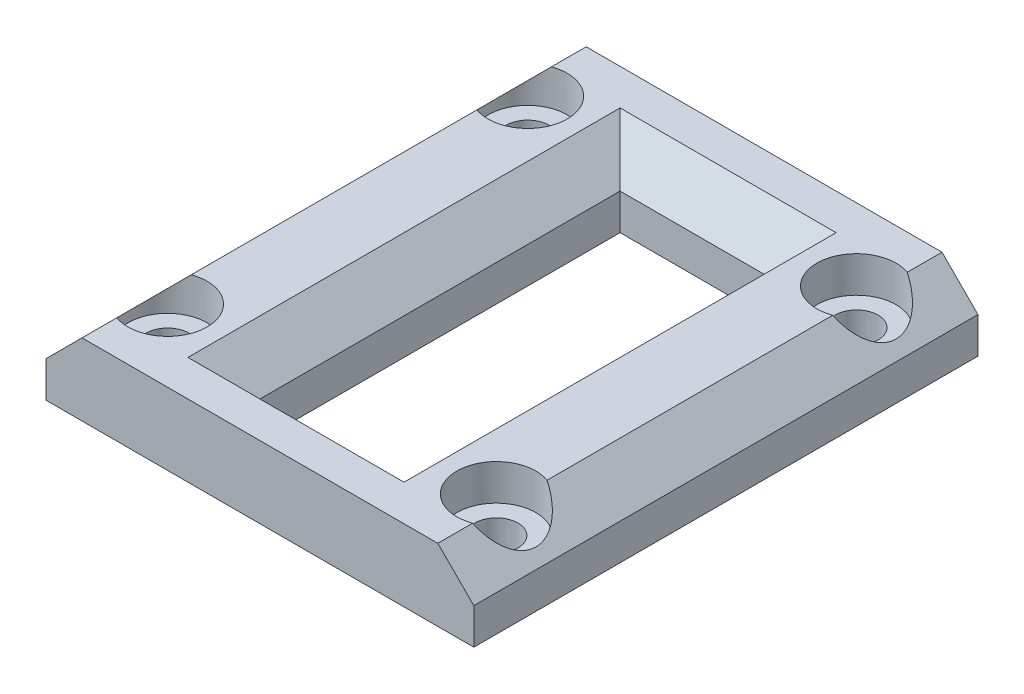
ISO-10303-21;
HEADER;
FILE_DESCRIPTION(('STEP AP214'),'2;1');
FILE_NAME('part.step','',(''),(''),'','','');
FILE_SCHEMA(('AUTOMOTIVE_DESIGN { 1 0 10303 214 1 1 1 1 }'));
ENDSEC;
DATA;
#1=APPLICATION_CONTEXT('core data for automotive mechanical design processes');
#2=APPLICATION_PROTOCOL_DEFINITION('international standard','automotive_design',2000,#1);
#3=PRODUCT_CONTEXT('',#1,'mechanical');
#4=PRODUCT('Part','Part','',(#3));
#5=PRODUCT_RELATED_PRODUCT_CATEGORY('part','',(#4));
#6=PRODUCT_DEFINITION_FORMATION('','',#4);
#7=PRODUCT_DEFINITION_CONTEXT('part definition',#1,'design');
#8=PRODUCT_DEFINITION('design','',#6,#7);
#9=PRODUCT_DEFINITION_SHAPE('','',#8);
#10=(LENGTH_UNIT() NAMED_UNIT(*) SI_UNIT(.MILLI.,.METRE.));
#11=(NAMED_UNIT(*) PLANE_ANGLE_UNIT() SI_UNIT($,.RADIAN.));
#12=(NAMED_UNIT(*) SI_UNIT($,.STERADIAN.) SOLID_ANGLE_UNIT());
#13=UNCERTAINTY_MEASURE_WITH_UNIT(LENGTH_MEASURE(1.E-05),#10,'distance_accuracy_value','');
#14=(GEOMETRIC_REPRESENTATION_CONTEXT(3) GLOBAL_UNCERTAINTY_ASSIGNED_CONTEXT((#13)) GLOBAL_UNIT_ASSIGNED_CONTEXT((#10,
#11,#12)) REPRESENTATION_CONTEXT('',''));
#15=CARTESIAN_POINT('',(0.,0.,0.));
#16=DIRECTION('',(0.,0.,1.));
#17=DIRECTION('',(1.,0.,0.));
#18=AXIS2_PLACEMENT_3D('',#15,#16,#17);
#19=CARTESIAN_POINT('',(0.,4.,0.));
#20=DIRECTION('',(1.,0.,0.));
#21=DIRECTION('',(0.,0.,-1.));
#22=AXIS2_PLACEMENT_3D('',#19,#20,#21);
#23=PLANE('',#22);
#24=DIRECTION('',(0.,-1.,0.));
#25=VECTOR('',#24,1.);
#26=CARTESIAN_POINT('',(0.,4.,28.));
#27=LINE('',#26,#25);
#28=CARTESIAN_POINT('',(0.,1.99999999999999,28.));
#29=VERTEX_POINT('',#28);
#30=CARTESIAN_POINT('',(0.,0.,28.));
#31=VERTEX_POINT('',#30);
#32=EDGE_CURVE('E257',#29,#31,#27,.T.);
#33=ORIENTED_EDGE('',*,*,#32,.F.);
#34=DIRECTION('',(0.,0.,-1.));
#35=VECTOR('',#34,1.);
#36=CARTESIAN_POINT('',(0.,1.99999999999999,0.));
#37=LINE('',#36,#35);
#38=CARTESIAN_POINT('',(0.,1.99999999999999,0.));
#39=VERTEX_POINT('',#38);
#40=EDGE_CURVE('E56',#29,#39,#37,.T.);
#41=ORIENTED_EDGE('',*,*,#40,.T.);
#42=DIRECTION('',(0.,-1.,0.));
#43=VECTOR('',#42,1.);
#44=CARTESIAN_POINT('',(0.,4.,0.));
#45=LINE('',#44,#43);
#46=CARTESIAN_POINT('',(0.,0.,0.));
#47=VERTEX_POINT('',#46);
#48=EDGE_CURVE('E241',#39,#47,#45,.T.);
#49=ORIENTED_EDGE('',*,*,#48,.T.);
#50=DIRECTION('',(0.,0.,1.));
#51=VECTOR('',#50,1.);
#52=CARTESIAN_POINT('',(0.,0.,0.));
#53=LINE('',#52,#51);
#54=EDGE_CURVE('E233',#47,#31,#53,.T.);
#55=ORIENTED_EDGE('',*,*,#54,.T.);
#56=EDGE_LOOP('',(#33,#41,#49,#55));
#57=FACE_BOUND('',#56,.T.);
#58=ADVANCED_FACE('F33',(#57),#23,.F.);
#59=CARTESIAN_POINT('',(0.,4.,28.));
#60=DIRECTION('',(0.,0.,-1.));
#61=DIRECTION('',(-1.,0.,0.));
#62=AXIS2_PLACEMENT_3D('',#59,#60,#61);
#63=PLANE('',#62);
#64=DIRECTION('',(1.,0.,0.));
#65=VECTOR('',#64,1.);
#66=CARTESIAN_POINT('',(0.,4.,28.));
#67=LINE('',#66,#65);
#68=CARTESIAN_POINT('',(2.,4.,28.));
#69=VERTEX_POINT('',#68);
#70=CARTESIAN_POINT('',(21.76,4.,28.));
#71=VERTEX_POINT('',#70);
#72=EDGE_CURVE('E234',#69,#71,#67,.T.);
#73=ORIENTED_EDGE('',*,*,#72,.F.);
#74=DIRECTION('',(-0.707106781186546,-0.707106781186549,0.));
#75=VECTOR('',#74,1.);
#76=CARTESIAN_POINT('',(2.,4.,28.));
#77=LINE('',#76,#75);
#78=EDGE_CURVE('E308',#69,#29,#77,.T.);
#79=ORIENTED_EDGE('',*,*,#78,.T.);
#80=ORIENTED_EDGE('',*,*,#32,.T.);
#81=DIRECTION('',(1.,0.,0.));
#82=VECTOR('',#81,1.);
#83=CARTESIAN_POINT('',(0.,0.,28.));
#84=LINE('',#83,#82);
#85=CARTESIAN_POINT('',(23.76,0.,28.));
#86=VERTEX_POINT('',#85);
#87=EDGE_CURVE('E244',#31,#86,#84,.T.);
#88=ORIENTED_EDGE('',*,*,#87,.T.);
#89=DIRECTION('',(0.,-1.,0.));
#90=VECTOR('',#89,1.);
#91=CARTESIAN_POINT('',(23.76,4.,28.));
#92=LINE('',#91,#90);
#93=CARTESIAN_POINT('',(23.76,1.99999999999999,28.));
#94=VERTEX_POINT('',#93);
#95=EDGE_CURVE('E255',#94,#86,#92,.T.);
#96=ORIENTED_EDGE('',*,*,#95,.F.);
#97=DIRECTION('',(-0.707106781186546,0.707106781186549,0.));
#98=VECTOR('',#97,1.);
#99=CARTESIAN_POINT('',(21.76,4.,28.));
#100=LINE('',#99,#98);
#101=EDGE_CURVE('E306',#94,#71,#100,.T.);
#102=ORIENTED_EDGE('',*,*,#101,.T.);
#103=EDGE_LOOP('',(#73,#79,#80,#88,#96,#102));
#104=FACE_BOUND('',#103,.T.);
#105=ADVANCED_FACE('F333',(#104),#63,.F.);
#106=CARTESIAN_POINT('',(23.76,4.,0.));
#107=DIRECTION('',(-1.,0.,0.));
#108=DIRECTION('',(0.,0.,1.));
#109=AXIS2_PLACEMENT_3D('',#106,#107,#108);
#110=PLANE('',#109);
#111=DIRECTION('',(0.,-1.,0.));
#112=VECTOR('',#111,1.);
#113=CARTESIAN_POINT('',(23.76,4.,0.));
#114=LINE('',#113,#112);
#115=CARTESIAN_POINT('',(23.76,1.99999999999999,0.));
#116=VERTEX_POINT('',#115);
#117=CARTESIAN_POINT('',(23.76,0.,0.));
#118=VERTEX_POINT('',#117);
#119=EDGE_CURVE('E253',#116,#118,#114,.T.);
#120=ORIENTED_EDGE('',*,*,#119,.F.);
#121=DIRECTION('',(0.,0.,1.));
#122=VECTOR('',#121,1.);
#123=CARTESIAN_POINT('',(23.76,1.99999999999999,28.));
#124=LINE('',#123,#122);
#125=EDGE_CURVE('E11',#116,#94,#124,.T.);
#126=ORIENTED_EDGE('',*,*,#125,.T.);
#127=ORIENTED_EDGE('',*,*,#95,.T.);
#128=DIRECTION('',(0.,0.,-1.));
#129=VECTOR('',#128,1.);
#130=CARTESIAN_POINT('',(23.76,0.,0.));
#131=LINE('',#130,#129);
#132=EDGE_CURVE('E247',#86,#118,#131,.T.);
#133=ORIENTED_EDGE('',*,*,#132,.T.);
#134=EDGE_LOOP('',(#120,#126,#127,#133));
#135=FACE_BOUND('',#134,.T.);
#136=ADVANCED_FACE('F330',(#135),#110,.F.);
#137=CARTESIAN_POINT('',(0.,4.,0.));
#138=DIRECTION('',(0.,0.,1.));
#139=DIRECTION('',(1.,0.,0.));
#140=AXIS2_PLACEMENT_3D('',#137,#138,#139);
#141=PLANE('',#140);
#142=ORIENTED_EDGE('',*,*,#48,.F.);
#143=DIRECTION('',(0.707106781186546,0.707106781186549,0.));
#144=VECTOR('',#143,1.);
#145=CARTESIAN_POINT('',(2.,4.,0.));
#146=LINE('',#145,#144);
#147=CARTESIAN_POINT('',(2.,4.,0.));
#148=VERTEX_POINT('',#147);
#149=EDGE_CURVE('E312',#39,#148,#146,.T.);
#150=ORIENTED_EDGE('',*,*,#149,.T.);
#151=DIRECTION('',(-1.,0.,0.));
#152=VECTOR('',#151,1.);
#153=CARTESIAN_POINT('',(0.,4.,0.));
#154=LINE('',#153,#152);
#155=CARTESIAN_POINT('',(21.76,4.,0.));
#156=VERTEX_POINT('',#155);
#157=EDGE_CURVE('E237',#156,#148,#154,.T.);
#158=ORIENTED_EDGE('',*,*,#157,.F.);
#159=DIRECTION('',(0.707106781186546,-0.707106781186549,0.));
#160=VECTOR('',#159,1.);
#161=CARTESIAN_POINT('',(21.76,4.,0.));
#162=LINE('',#161,#160);
#163=EDGE_CURVE('E48',#156,#116,#162,.T.);
#164=ORIENTED_EDGE('',*,*,#163,.T.);
#165=ORIENTED_EDGE('',*,*,#119,.T.);
#166=DIRECTION('',(-1.,0.,0.));
#167=VECTOR('',#166,1.);
#168=CARTESIAN_POINT('',(0.,0.,0.));
#169=LINE('',#168,#167);
#170=EDGE_CURVE('E238',#118,#47,#169,.T.);
#171=ORIENTED_EDGE('',*,*,#170,.T.);
#172=EDGE_LOOP('',(#142,#150,#158,#164,#165,#171));
#173=FACE_BOUND('',#172,.T.);
#174=ADVANCED_FACE('F339',(#173),#141,.F.);
#175=CARTESIAN_POINT('',(0.,4.,0.));
#176=DIRECTION('',(0.,1.,0.));
#177=DIRECTION('',(0.,0.,1.));
#178=AXIS2_PLACEMENT_3D('',#175,#176,#177);
#179=PLANE('',#178);
#180=DIRECTION('',(1.,0.,0.));
#181=VECTOR('',#180,1.);
#182=CARTESIAN_POINT('',(15.882828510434,4.,1.99999999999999));
#183=LINE('',#182,#181);
#184=CARTESIAN_POINT('',(5.88282851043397,4.,1.99999999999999));
#185=VERTEX_POINT('',#184);
#186=CARTESIAN_POINT('',(17.882828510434,4.,1.99999999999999));
#187=VERTEX_POINT('',#186);
#188=EDGE_CURVE('E261',#185,#187,#183,.T.);
#189=ORIENTED_EDGE('',*,*,#188,.T.);
#190=DIRECTION('',(0.,0.,1.));
#191=VECTOR('',#190,1.);
#192=CARTESIAN_POINT('',(17.882828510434,4.,26.));
#193=LINE('',#192,#191);
#194=CARTESIAN_POINT('',(17.882828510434,4.,26.));
#195=VERTEX_POINT('',#194);
#196=EDGE_CURVE('E274',#187,#195,#193,.T.);
#197=ORIENTED_EDGE('',*,*,#196,.T.);
#198=DIRECTION('',(-1.,0.,0.));
#199=VECTOR('',#198,1.);
#200=CARTESIAN_POINT('',(7.88282851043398,4.,26.));
#201=LINE('',#200,#199);
#202=CARTESIAN_POINT('',(5.88282851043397,4.,26.));
#203=VERTEX_POINT('',#202);
#204=EDGE_CURVE('E263',#195,#203,#201,.T.);
#205=ORIENTED_EDGE('',*,*,#204,.T.);
#206=DIRECTION('',(0.,0.,-1.));
#207=VECTOR('',#206,1.);
#208=CARTESIAN_POINT('',(5.88282851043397,4.,1.99999999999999));
#209=LINE('',#208,#207);
#210=EDGE_CURVE('E271',#203,#185,#209,.T.);
#211=ORIENTED_EDGE('',*,*,#210,.T.);
#212=EDGE_LOOP('',(#189,#197,#205,#211));
#213=FACE_BOUND('',#212,.T.);
#214=ORIENTED_EDGE('',*,*,#157,.T.);
#215=DIRECTION('',(0.,0.,1.));
#216=VECTOR('',#215,1.);
#217=CARTESIAN_POINT('',(2.,4.,28.));
#218=LINE('',#217,#216);
#219=CARTESIAN_POINT('',(2.,4.,1.93178821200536));
#220=VERTEX_POINT('',#219);
#221=EDGE_CURVE('E299',#148,#220,#218,.T.);
#222=ORIENTED_EDGE('',*,*,#221,.T.);
#223=CARTESIAN_POINT('',(2.75,4.,4.));
#224=DIRECTION('',(0.,1.,0.));
#225=DIRECTION('',(0.,0.,1.));
#226=AXIS2_PLACEMENT_3D('',#223,#224,#225);
#227=CIRCLE('',#226,2.19999999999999);
#228=CARTESIAN_POINT('',(2.,4.,6.06821178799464));
#229=VERTEX_POINT('',#228);
#230=EDGE_CURVE('E181',#229,#220,#227,.T.);
#231=ORIENTED_EDGE('',*,*,#230,.F.);
#232=DIRECTION('',(0.,0.,1.));
#233=VECTOR('',#232,1.);
#234=CARTESIAN_POINT('',(2.,4.,28.));
#235=LINE('',#234,#233);
#236=CARTESIAN_POINT('',(2.,4.,21.9317882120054));
#237=VERTEX_POINT('',#236);
#238=EDGE_CURVE('E297',#229,#237,#235,.T.);
#239=ORIENTED_EDGE('',*,*,#238,.T.);
#240=CARTESIAN_POINT('',(2.75,4.,24.));
#241=DIRECTION('',(0.,1.,0.));
#242=DIRECTION('',(0.,0.,1.));
#243=AXIS2_PLACEMENT_3D('',#240,#241,#242);
#244=CIRCLE('',#243,2.19999999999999);
#245=CARTESIAN_POINT('',(2.,4.,26.0682117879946));
#246=VERTEX_POINT('',#245);
#247=EDGE_CURVE('E197',#246,#237,#244,.T.);
#248=ORIENTED_EDGE('',*,*,#247,.F.);
#249=DIRECTION('',(0.,0.,1.));
#250=VECTOR('',#249,1.);
#251=CARTESIAN_POINT('',(2.,4.,28.));
#252=LINE('',#251,#250);
#253=EDGE_CURVE('E295',#246,#69,#252,.T.);
#254=ORIENTED_EDGE('',*,*,#253,.T.);
#255=ORIENTED_EDGE('',*,*,#72,.T.);
#256=DIRECTION('',(0.,0.,-1.));
#257=VECTOR('',#256,1.);
#258=CARTESIAN_POINT('',(21.76,4.,0.));
#259=LINE('',#258,#257);
#260=CARTESIAN_POINT('',(21.76,4.,26.0682117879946));
#261=VERTEX_POINT('',#260);
#262=EDGE_CURVE('E292',#71,#261,#259,.T.);
#263=ORIENTED_EDGE('',*,*,#262,.T.);
#264=CARTESIAN_POINT('',(21.01,4.,24.));
#265=DIRECTION('',(0.,1.,0.));
#266=DIRECTION('',(0.,0.,1.));
#267=AXIS2_PLACEMENT_3D('',#264,#265,#266);
#268=CIRCLE('',#267,2.19999999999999);
#269=CARTESIAN_POINT('',(21.76,4.,21.9317882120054));
#270=VERTEX_POINT('',#269);
#271=EDGE_CURVE('E209',#270,#261,#268,.T.);
#272=ORIENTED_EDGE('',*,*,#271,.F.);
#273=DIRECTION('',(0.,0.,-1.));
#274=VECTOR('',#273,1.);
#275=CARTESIAN_POINT('',(21.76,4.,0.));
#276=LINE('',#275,#274);
#277=CARTESIAN_POINT('',(21.76,4.,6.06821178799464));
#278=VERTEX_POINT('',#277);
#279=EDGE_CURVE('E290',#270,#278,#276,.T.);
#280=ORIENTED_EDGE('',*,*,#279,.T.);
#281=CARTESIAN_POINT('',(21.01,4.,4.));
#282=DIRECTION('',(0.,1.,0.));
#283=DIRECTION('',(0.,0.,1.));
#284=AXIS2_PLACEMENT_3D('',#281,#282,#283);
#285=CIRCLE('',#284,2.19999999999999);
#286=CARTESIAN_POINT('',(21.76,4.,1.93178821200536));
#287=VERTEX_POINT('',#286);
#288=EDGE_CURVE('E221',#287,#278,#285,.T.);
#289=ORIENTED_EDGE('',*,*,#288,.F.);
#290=DIRECTION('',(0.,0.,-1.));
#291=VECTOR('',#290,1.);
#292=CARTESIAN_POINT('',(21.76,4.,0.));
#293=LINE('',#292,#291);
#294=EDGE_CURVE('E288',#287,#156,#293,.T.);
#295=ORIENTED_EDGE('',*,*,#294,.T.);
#296=EDGE_LOOP('',(#214,#222,#231,#239,#248,#254,#255,#263,#272,#280,#289,#295));
#297=FACE_BOUND('',#296,.T.);
#298=ADVANCED_FACE('F323',(#213,#297),#179,.T.);
#299=CARTESIAN_POINT('',(0.,0.,0.));
#300=DIRECTION('',(0.,1.,0.));
#301=DIRECTION('',(0.,0.,1.));
#302=AXIS2_PLACEMENT_3D('',#299,#300,#301);
#303=PLANE('',#302);
#304=DIRECTION('',(-1.,0.,0.));
#305=VECTOR('',#304,1.);
#306=CARTESIAN_POINT('',(7.88282851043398,0.,4.));
#307=LINE('',#306,#305);
#308=CARTESIAN_POINT('',(15.882828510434,0.,4.));
#309=VERTEX_POINT('',#308);
#310=CARTESIAN_POINT('',(7.88282851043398,0.,4.));
#311=VERTEX_POINT('',#310);
#312=EDGE_CURVE('E161',#309,#311,#307,.T.);
#313=ORIENTED_EDGE('',*,*,#312,.T.);
#314=DIRECTION('',(0.,0.,1.));
#315=VECTOR('',#314,1.);
#316=CARTESIAN_POINT('',(7.88282851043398,0.,4.));
#317=LINE('',#316,#315);
#318=CARTESIAN_POINT('',(7.88282851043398,0.,24.));
#319=VERTEX_POINT('',#318);
#320=EDGE_CURVE('E153',#311,#319,#317,.T.);
#321=ORIENTED_EDGE('',*,*,#320,.T.);
#322=DIRECTION('',(1.,0.,0.));
#323=VECTOR('',#322,1.);
#324=CARTESIAN_POINT('',(7.88282851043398,0.,24.));
#325=LINE('',#324,#323);
#326=CARTESIAN_POINT('',(15.882828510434,0.,24.));
#327=VERTEX_POINT('',#326);
#328=EDGE_CURVE('E165',#319,#327,#325,.T.);
#329=ORIENTED_EDGE('',*,*,#328,.T.);
#330=DIRECTION('',(0.,0.,-1.));
#331=VECTOR('',#330,1.);
#332=CARTESIAN_POINT('',(15.882828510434,0.,4.));
#333=LINE('',#332,#331);
#334=EDGE_CURVE('E170',#327,#309,#333,.T.);
#335=ORIENTED_EDGE('',*,*,#334,.T.);
#336=EDGE_LOOP('',(#313,#321,#329,#335));
#337=FACE_BOUND('',#336,.T.);
#338=CARTESIAN_POINT('',(2.75,0.,4.));
#339=DIRECTION('',(0.,1.,0.));
#340=DIRECTION('',(0.,0.,1.));
#341=AXIS2_PLACEMENT_3D('',#338,#339,#340);
#342=CIRCLE('',#341,1.2);
#343=CARTESIAN_POINT('',(2.75,0.,5.2));
#344=VERTEX_POINT('',#343);
#345=EDGE_CURVE('E194',#344,#344,#342,.T.);
#346=ORIENTED_EDGE('',*,*,#345,.T.);
#347=EDGE_LOOP('',(#346));
#348=FACE_BOUND('',#347,.T.);
#349=CARTESIAN_POINT('',(2.75,0.,24.));
#350=DIRECTION('',(0.,1.,0.));
#351=DIRECTION('',(0.,0.,1.));
#352=AXIS2_PLACEMENT_3D('',#349,#350,#351);
#353=CIRCLE('',#352,1.2);
#354=CARTESIAN_POINT('',(2.75,0.,25.2));
#355=VERTEX_POINT('',#354);
#356=EDGE_CURVE('E206',#355,#355,#353,.T.);
#357=ORIENTED_EDGE('',*,*,#356,.T.);
#358=EDGE_LOOP('',(#357));
#359=FACE_BOUND('',#358,.T.);
#360=CARTESIAN_POINT('',(21.01,0.,24.));
#361=DIRECTION('',(0.,1.,0.));
#362=DIRECTION('',(0.,0.,1.));
#363=AXIS2_PLACEMENT_3D('',#360,#361,#362);
#364=CIRCLE('',#363,1.2);
#365=CARTESIAN_POINT('',(21.01,0.,25.2));
#366=VERTEX_POINT('',#365);
#367=EDGE_CURVE('E218',#366,#366,#364,.T.);
#368=ORIENTED_EDGE('',*,*,#367,.T.);
#369=EDGE_LOOP('',(#368));
#370=FACE_BOUND('',#369,.T.);
#371=CARTESIAN_POINT('',(21.01,0.,4.));
#372=DIRECTION('',(0.,1.,0.));
#373=DIRECTION('',(0.,0.,1.));
#374=AXIS2_PLACEMENT_3D('',#371,#372,#373);
#375=CIRCLE('',#374,1.2);
#376=CARTESIAN_POINT('',(21.01,0.,5.2));
#377=VERTEX_POINT('',#376);
#378=EDGE_CURVE('E230',#377,#377,#375,.T.);
#379=ORIENTED_EDGE('',*,*,#378,.T.);
#380=EDGE_LOOP('',(#379));
#381=FACE_BOUND('',#380,.T.);
#382=ORIENTED_EDGE('',*,*,#54,.F.);
#383=ORIENTED_EDGE('',*,*,#170,.F.);
#384=ORIENTED_EDGE('',*,*,#132,.F.);
#385=ORIENTED_EDGE('',*,*,#87,.F.);
#386=EDGE_LOOP('',(#382,#383,#384,#385));
#387=FACE_BOUND('',#386,.T.);
#388=ADVANCED_FACE('F172',(#337,#348,#359,#370,#381,#387),#303,.F.);
#389=CARTESIAN_POINT('',(21.01,4.,4.));
#390=DIRECTION('',(0.,1.,0.));
#391=DIRECTION('',(0.,0.,1.));
#392=AXIS2_PLACEMENT_3D('',#389,#390,#391);
#393=CYLINDRICAL_SURFACE('',#392,1.2);
#394=ORIENTED_EDGE('',*,*,#378,.F.);
#395=EDGE_LOOP('',(#394));
#396=FACE_BOUND('',#395,.T.);
#397=CARTESIAN_POINT('',(21.01,2.,4.));
#398=DIRECTION('',(0.,1.,0.));
#399=DIRECTION('',(0.,0.,1.));
#400=AXIS2_PLACEMENT_3D('',#397,#398,#399);
#401=CIRCLE('',#400,1.20000000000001);
#402=CARTESIAN_POINT('',(21.01,2.,5.20000000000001));
#403=VERTEX_POINT('',#402);
#404=EDGE_CURVE('E227',#403,#403,#401,.T.);
#405=ORIENTED_EDGE('',*,*,#404,.T.);
#406=EDGE_LOOP('',(#405));
#407=FACE_BOUND('',#406,.T.);
#408=ADVANCED_FACE('F547',(#396,#407),#393,.F.);
#409=CARTESIAN_POINT('',(22.21,2.,4.));
#410=DIRECTION('',(0.,-1.,0.));
#411=DIRECTION('',(0.,0.,-1.));
#412=AXIS2_PLACEMENT_3D('',#409,#410,#411);
#413=PLANE('',#412);
#414=ORIENTED_EDGE('',*,*,#404,.F.);
#415=EDGE_LOOP('',(#414));
#416=FACE_BOUND('',#415,.T.);
#417=CARTESIAN_POINT('',(21.01,2.,4.));
#418=DIRECTION('',(0.,1.,0.));
#419=DIRECTION('',(0.,0.,1.));
#420=AXIS2_PLACEMENT_3D('',#417,#418,#419);
#421=CIRCLE('',#420,2.19999999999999);
#422=CARTESIAN_POINT('',(21.01,2.,6.19999999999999));
#423=VERTEX_POINT('',#422);
#424=EDGE_CURVE('E224',#423,#423,#421,.T.);
#425=ORIENTED_EDGE('',*,*,#424,.T.);
#426=EDGE_LOOP('',(#425));
#427=FACE_BOUND('',#426,.T.);
#428=ADVANCED_FACE('F444',(#416,#427),#413,.F.);
#429=CARTESIAN_POINT('',(21.01,4.,4.));
#430=DIRECTION('',(0.,1.,0.));
#431=DIRECTION('',(0.,0.,1.));
#432=AXIS2_PLACEMENT_3D('',#429,#430,#431);
#433=CYLINDRICAL_SURFACE('',#432,2.19999999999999);
#434=ORIENTED_EDGE('',*,*,#424,.F.);
#435=EDGE_LOOP('',(#434));
#436=FACE_BOUND('',#435,.T.);
#437=ORIENTED_EDGE('',*,*,#288,.T.);
#438=CARTESIAN_POINT('',(21.01,4.75,4.));
#439=DIRECTION('',(0.707106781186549,0.707106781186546,0.));
#440=DIRECTION('',(-0.707106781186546,0.707106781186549,0.));
#441=AXIS2_PLACEMENT_3D('',#438,#439,#440);
#442=ELLIPSE('',#441,3.11126983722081,2.19999999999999);
#443=EDGE_CURVE('E41',#278,#287,#442,.T.);
#444=ORIENTED_EDGE('',*,*,#443,.T.);
#445=EDGE_LOOP('',(#437,#444));
#446=FACE_BOUND('',#445,.T.);
#447=ADVANCED_FACE('F318',(#436,#446),#433,.F.);
#448=CARTESIAN_POINT('',(21.01,4.,24.));
#449=DIRECTION('',(0.,1.,0.));
#450=DIRECTION('',(0.,0.,1.));
#451=AXIS2_PLACEMENT_3D('',#448,#449,#450);
#452=CYLINDRICAL_SURFACE('',#451,1.2);
#453=ORIENTED_EDGE('',*,*,#367,.F.);
#454=EDGE_LOOP('',(#453));
#455=FACE_BOUND('',#454,.T.);
#456=CARTESIAN_POINT('',(21.01,2.,24.));
#457=DIRECTION('',(0.,1.,0.));
#458=DIRECTION('',(0.,0.,1.));
#459=AXIS2_PLACEMENT_3D('',#456,#457,#458);
#460=CIRCLE('',#459,1.20000000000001);
#461=CARTESIAN_POINT('',(21.01,2.,25.2));
#462=VERTEX_POINT('',#461);
#463=EDGE_CURVE('E215',#462,#462,#460,.T.);
#464=ORIENTED_EDGE('',*,*,#463,.T.);
#465=EDGE_LOOP('',(#464));
#466=FACE_BOUND('',#465,.T.);
#467=ADVANCED_FACE('F443',(#455,#466),#452,.F.);
#468=CARTESIAN_POINT('',(22.21,2.,24.));
#469=DIRECTION('',(0.,-1.,0.));
#470=DIRECTION('',(0.,0.,-1.));
#471=AXIS2_PLACEMENT_3D('',#468,#469,#470);
#472=PLANE('',#471);
#473=ORIENTED_EDGE('',*,*,#463,.F.);
#474=EDGE_LOOP('',(#473));
#475=FACE_BOUND('',#474,.T.);
#476=CARTESIAN_POINT('',(21.01,2.,24.));
#477=DIRECTION('',(0.,1.,0.));
#478=DIRECTION('',(0.,0.,1.));
#479=AXIS2_PLACEMENT_3D('',#476,#477,#478);
#480=CIRCLE('',#479,2.19999999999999);
#481=CARTESIAN_POINT('',(21.01,2.,26.2));
#482=VERTEX_POINT('',#481);
#483=EDGE_CURVE('E212',#482,#482,#480,.T.);
#484=ORIENTED_EDGE('',*,*,#483,.T.);
#485=EDGE_LOOP('',(#484));
#486=FACE_BOUND('',#485,.T.);
#487=ADVANCED_FACE('F429',(#475,#486),#472,.F.);
#488=CARTESIAN_POINT('',(21.01,4.,24.));
#489=DIRECTION('',(0.,1.,0.));
#490=DIRECTION('',(0.,0.,1.));
#491=AXIS2_PLACEMENT_3D('',#488,#489,#490);
#492=CYLINDRICAL_SURFACE('',#491,2.19999999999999);
#493=ORIENTED_EDGE('',*,*,#483,.F.);
#494=EDGE_LOOP('',(#493));
#495=FACE_BOUND('',#494,.T.);
#496=ORIENTED_EDGE('',*,*,#271,.T.);
#497=CARTESIAN_POINT('',(21.01,4.75,24.));
#498=DIRECTION('',(0.707106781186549,0.707106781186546,0.));
#499=DIRECTION('',(-0.707106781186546,0.707106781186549,0.));
#500=AXIS2_PLACEMENT_3D('',#497,#498,#499);
#501=ELLIPSE('',#500,3.11126983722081,2.19999999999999);
#502=EDGE_CURVE('E314',#261,#270,#501,.T.);
#503=ORIENTED_EDGE('',*,*,#502,.T.);
#504=EDGE_LOOP('',(#496,#503));
#505=FACE_BOUND('',#504,.T.);
#506=ADVANCED_FACE('F423',(#495,#505),#492,.F.);
#507=CARTESIAN_POINT('',(2.75,4.,24.));
#508=DIRECTION('',(0.,1.,0.));
#509=DIRECTION('',(0.,0.,1.));
#510=AXIS2_PLACEMENT_3D('',#507,#508,#509);
#511=CYLINDRICAL_SURFACE('',#510,1.20000000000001);
#512=ORIENTED_EDGE('',*,*,#356,.F.);
#513=EDGE_LOOP('',(#512));
#514=FACE_BOUND('',#513,.T.);
#515=CARTESIAN_POINT('',(2.75,2.,24.));
#516=DIRECTION('',(0.,1.,0.));
#517=DIRECTION('',(0.,0.,1.));
#518=AXIS2_PLACEMENT_3D('',#515,#516,#517);
#519=CIRCLE('',#518,1.20000000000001);
#520=CARTESIAN_POINT('',(2.75,2.,25.2));
#521=VERTEX_POINT('',#520);
#522=EDGE_CURVE('E203',#521,#521,#519,.T.);
#523=ORIENTED_EDGE('',*,*,#522,.T.);
#524=EDGE_LOOP('',(#523));
#525=FACE_BOUND('',#524,.T.);
#526=ADVANCED_FACE('F428',(#514,#525),#511,.F.);
#527=CARTESIAN_POINT('',(3.95000000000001,2.,24.));
#528=DIRECTION('',(0.,-1.,0.));
#529=DIRECTION('',(0.,0.,-1.));
#530=AXIS2_PLACEMENT_3D('',#527,#528,#529);
#531=PLANE('',#530);
#532=ORIENTED_EDGE('',*,*,#522,.F.);
#533=EDGE_LOOP('',(#532));
#534=FACE_BOUND('',#533,.T.);
#535=CARTESIAN_POINT('',(2.75,2.,24.));
#536=DIRECTION('',(0.,1.,0.));
#537=DIRECTION('',(0.,0.,1.));
#538=AXIS2_PLACEMENT_3D('',#535,#536,#537);
#539=CIRCLE('',#538,2.19999999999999);
#540=CARTESIAN_POINT('',(2.75,2.,26.2));
#541=VERTEX_POINT('',#540);
#542=EDGE_CURVE('E200',#541,#541,#539,.T.);
#543=ORIENTED_EDGE('',*,*,#542,.T.);
#544=EDGE_LOOP('',(#543));
#545=FACE_BOUND('',#544,.T.);
#546=ADVANCED_FACE('F413',(#534,#545),#531,.F.);
#547=CARTESIAN_POINT('',(2.75,4.,24.));
#548=DIRECTION('',(0.,1.,0.));
#549=DIRECTION('',(0.,0.,1.));
#550=AXIS2_PLACEMENT_3D('',#547,#548,#549);
#551=CYLINDRICAL_SURFACE('',#550,2.19999999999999);
#552=ORIENTED_EDGE('',*,*,#542,.F.);
#553=EDGE_LOOP('',(#552));
#554=FACE_BOUND('',#553,.T.);
#555=ORIENTED_EDGE('',*,*,#247,.T.);
#556=CARTESIAN_POINT('',(2.75,4.75,24.));
#557=DIRECTION('',(-0.707106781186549,0.707106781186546,0.));
#558=DIRECTION('',(0.707106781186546,0.707106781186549,0.));
#559=AXIS2_PLACEMENT_3D('',#556,#557,#558);
#560=ELLIPSE('',#559,3.11126983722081,2.19999999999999);
#561=EDGE_CURVE('E304',#237,#246,#560,.T.);
#562=ORIENTED_EDGE('',*,*,#561,.T.);
#563=EDGE_LOOP('',(#555,#562));
#564=FACE_BOUND('',#563,.T.);
#565=ADVANCED_FACE('F408',(#554,#564),#551,.F.);
#566=CARTESIAN_POINT('',(2.75,4.,4.));
#567=DIRECTION('',(0.,1.,0.));
#568=DIRECTION('',(0.,0.,1.));
#569=AXIS2_PLACEMENT_3D('',#566,#567,#568);
#570=CYLINDRICAL_SURFACE('',#569,1.20000000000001);
#571=ORIENTED_EDGE('',*,*,#345,.F.);
#572=EDGE_LOOP('',(#571));
#573=FACE_BOUND('',#572,.T.);
#574=CARTESIAN_POINT('',(2.75,2.,4.));
#575=DIRECTION('',(0.,1.,0.));
#576=DIRECTION('',(0.,0.,1.));
#577=AXIS2_PLACEMENT_3D('',#574,#575,#576);
#578=CIRCLE('',#577,1.20000000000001);
#579=CARTESIAN_POINT('',(2.75,2.,5.20000000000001));
#580=VERTEX_POINT('',#579);
#581=EDGE_CURVE('E191',#580,#580,#578,.T.);
#582=ORIENTED_EDGE('',*,*,#581,.T.);
#583=EDGE_LOOP('',(#582));
#584=FACE_BOUND('',#583,.T.);
#585=ADVANCED_FACE('F359',(#573,#584),#570,.F.);
#586=CARTESIAN_POINT('',(3.95000000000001,2.,4.));
#587=DIRECTION('',(0.,-1.,0.));
#588=DIRECTION('',(0.,0.,-1.));
#589=AXIS2_PLACEMENT_3D('',#586,#587,#588);
#590=PLANE('',#589);
#591=ORIENTED_EDGE('',*,*,#581,.F.);
#592=EDGE_LOOP('',(#591));
#593=FACE_BOUND('',#592,.T.);
#594=CARTESIAN_POINT('',(2.75,2.,4.));
#595=DIRECTION('',(0.,1.,0.));
#596=DIRECTION('',(0.,0.,1.));
#597=AXIS2_PLACEMENT_3D('',#594,#595,#596);
#598=CIRCLE('',#597,2.19999999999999);
#599=CARTESIAN_POINT('',(2.75,2.,6.19999999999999));
#600=VERTEX_POINT('',#599);
#601=EDGE_CURVE('E188',#600,#600,#598,.T.);
#602=ORIENTED_EDGE('',*,*,#601,.T.);
#603=EDGE_LOOP('',(#602));
#604=FACE_BOUND('',#603,.T.);
#605=ADVANCED_FACE('F350',(#593,#604),#590,.F.);
#606=CARTESIAN_POINT('',(2.75,4.,4.));
#607=DIRECTION('',(0.,1.,0.));
#608=DIRECTION('',(0.,0.,1.));
#609=AXIS2_PLACEMENT_3D('',#606,#607,#608);
#610=CYLINDRICAL_SURFACE('',#609,2.19999999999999);
#611=ORIENTED_EDGE('',*,*,#601,.F.);
#612=EDGE_LOOP('',(#611));
#613=FACE_BOUND('',#612,.T.);
#614=ORIENTED_EDGE('',*,*,#230,.T.);
#615=CARTESIAN_POINT('',(2.75,4.75,4.));
#616=DIRECTION('',(-0.707106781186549,0.707106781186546,0.));
#617=DIRECTION('',(0.707106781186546,0.707106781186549,0.));
#618=AXIS2_PLACEMENT_3D('',#615,#616,#617);
#619=ELLIPSE('',#618,3.11126983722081,2.19999999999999);
#620=EDGE_CURVE('E302',#220,#229,#619,.T.);
#621=ORIENTED_EDGE('',*,*,#620,.T.);
#622=EDGE_LOOP('',(#614,#621));
#623=FACE_BOUND('',#622,.T.);
#624=ADVANCED_FACE('F348',(#613,#623),#610,.F.);
#625=CARTESIAN_POINT('',(7.88282851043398,0.,4.));
#626=DIRECTION('',(-1.,0.,0.));
#627=DIRECTION('',(0.,0.,1.));
#628=AXIS2_PLACEMENT_3D('',#625,#626,#627);
#629=PLANE('',#628);
#630=DIRECTION('',(0.,1.,0.));
#631=VECTOR('',#630,1.);
#632=CARTESIAN_POINT('',(7.88282851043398,0.,4.));
#633=LINE('',#632,#631);
#634=CARTESIAN_POINT('',(7.88282851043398,2.,4.));
#635=VERTEX_POINT('',#634);
#636=EDGE_CURVE('E179',#311,#635,#633,.T.);
#637=ORIENTED_EDGE('',*,*,#636,.T.);
#638=DIRECTION('',(0.,0.,1.));
#639=VECTOR('',#638,1.);
#640=CARTESIAN_POINT('',(7.88282851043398,2.,26.));
#641=LINE('',#640,#639);
#642=CARTESIAN_POINT('',(7.88282851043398,2.,24.));
#643=VERTEX_POINT('',#642);
#644=EDGE_CURVE('E156',#635,#643,#641,.T.);
#645=ORIENTED_EDGE('',*,*,#644,.T.);
#646=DIRECTION('',(0.,1.,0.));
#647=VECTOR('',#646,1.);
#648=CARTESIAN_POINT('',(7.88282851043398,0.,24.));
#649=LINE('',#648,#647);
#650=EDGE_CURVE('E148',#319,#643,#649,.T.);
#651=ORIENTED_EDGE('',*,*,#650,.F.);
#652=ORIENTED_EDGE('',*,*,#320,.F.);
#653=EDGE_LOOP('',(#637,#645,#651,#652));
#654=FACE_BOUND('',#653,.T.);
#655=ADVANCED_FACE('F151',(#654),#629,.F.);
#656=CARTESIAN_POINT('',(7.88282851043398,0.,4.));
#657=DIRECTION('',(0.,0.,-1.));
#658=DIRECTION('',(-1.,0.,0.));
#659=AXIS2_PLACEMENT_3D('',#656,#657,#658);
#660=PLANE('',#659);
#661=DIRECTION('',(0.,1.,0.));
#662=VECTOR('',#661,1.);
#663=CARTESIAN_POINT('',(15.882828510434,0.,4.));
#664=LINE('',#663,#662);
#665=CARTESIAN_POINT('',(15.882828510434,2.,4.));
#666=VERTEX_POINT('',#665);
#667=EDGE_CURVE('E182',#309,#666,#664,.T.);
#668=ORIENTED_EDGE('',*,*,#667,.T.);
#669=DIRECTION('',(-1.,0.,0.));
#670=VECTOR('',#669,1.);
#671=CARTESIAN_POINT('',(7.88282851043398,2.,4.));
#672=LINE('',#671,#670);
#673=EDGE_CURVE('E265',#666,#635,#672,.T.);
#674=ORIENTED_EDGE('',*,*,#673,.T.);
#675=ORIENTED_EDGE('',*,*,#636,.F.);
#676=ORIENTED_EDGE('',*,*,#312,.F.);
#677=EDGE_LOOP('',(#668,#674,#675,#676));
#678=FACE_BOUND('',#677,.T.);
#679=ADVANCED_FACE('F357',(#678),#660,.F.);
#680=CARTESIAN_POINT('',(15.882828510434,0.,4.));
#681=DIRECTION('',(1.,0.,0.));
#682=DIRECTION('',(0.,0.,-1.));
#683=AXIS2_PLACEMENT_3D('',#680,#681,#682);
#684=PLANE('',#683);
#685=DIRECTION('',(0.,1.,0.));
#686=VECTOR('',#685,1.);
#687=CARTESIAN_POINT('',(15.882828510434,0.,24.));
#688=LINE('',#687,#686);
#689=CARTESIAN_POINT('',(15.882828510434,2.,24.));
#690=VERTEX_POINT('',#689);
#691=EDGE_CURVE('E160',#327,#690,#688,.T.);
#692=ORIENTED_EDGE('',*,*,#691,.T.);
#693=DIRECTION('',(0.,0.,-1.));
#694=VECTOR('',#693,1.);
#695=CARTESIAN_POINT('',(15.882828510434,2.,2.));
#696=LINE('',#695,#694);
#697=EDGE_CURVE('E268',#690,#666,#696,.T.);
#698=ORIENTED_EDGE('',*,*,#697,.T.);
#699=ORIENTED_EDGE('',*,*,#667,.F.);
#700=ORIENTED_EDGE('',*,*,#334,.F.);
#701=EDGE_LOOP('',(#692,#698,#699,#700));
#702=FACE_BOUND('',#701,.T.);
#703=ADVANCED_FACE('F517',(#702),#684,.F.);
#704=CARTESIAN_POINT('',(7.88282851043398,0.,24.));
#705=DIRECTION('',(0.,0.,1.));
#706=DIRECTION('',(1.,0.,0.));
#707=AXIS2_PLACEMENT_3D('',#704,#705,#706);
#708=PLANE('',#707);
#709=ORIENTED_EDGE('',*,*,#650,.T.);
#710=DIRECTION('',(1.,0.,0.));
#711=VECTOR('',#710,1.);
#712=CARTESIAN_POINT('',(15.882828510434,2.,24.));
#713=LINE('',#712,#711);
#714=EDGE_CURVE('E259',#643,#690,#713,.T.);
#715=ORIENTED_EDGE('',*,*,#714,.T.);
#716=ORIENTED_EDGE('',*,*,#691,.F.);
#717=ORIENTED_EDGE('',*,*,#328,.F.);
#718=EDGE_LOOP('',(#709,#715,#716,#717));
#719=FACE_BOUND('',#718,.T.);
#720=ADVANCED_FACE('F166',(#719),#708,.F.);
#721=CARTESIAN_POINT('',(7.88282851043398,2.,24.));
#722=DIRECTION('',(0.,0.707106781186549,-0.707106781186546));
#723=DIRECTION('',(-1.,0.,0.));
#724=AXIS2_PLACEMENT_3D('',#721,#722,#723);
#725=PLANE('',#724);
#726=ORIENTED_EDGE('',*,*,#714,.F.);
#727=DIRECTION('',(-0.577350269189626,0.577350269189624,0.577350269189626));
#728=VECTOR('',#727,1.);
#729=CARTESIAN_POINT('',(14.5494951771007,-4.66666666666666,17.3333333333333));
#730=LINE('',#729,#728);
#731=EDGE_CURVE('E283',#643,#203,#730,.T.);
#732=ORIENTED_EDGE('',*,*,#731,.T.);
#733=ORIENTED_EDGE('',*,*,#204,.F.);
#734=DIRECTION('',(-0.577350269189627,-0.577350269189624,-0.577350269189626));
#735=VECTOR('',#734,1.);
#736=CARTESIAN_POINT('',(9.2161618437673,-4.66666666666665,17.3333333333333));
#737=LINE('',#736,#735);
#738=EDGE_CURVE('E281',#195,#690,#737,.T.);
#739=ORIENTED_EDGE('',*,*,#738,.T.);
#740=EDGE_LOOP('',(#726,#732,#733,#739));
#741=FACE_BOUND('',#740,.T.);
#742=ADVANCED_FACE('F371',(#741),#725,.T.);
#743=CARTESIAN_POINT('',(7.88282851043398,2.,4.));
#744=DIRECTION('',(0.,0.707106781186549,0.707106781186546));
#745=DIRECTION('',(1.,0.,0.));
#746=AXIS2_PLACEMENT_3D('',#743,#744,#745);
#747=PLANE('',#746);
#748=ORIENTED_EDGE('',*,*,#673,.F.);
#749=DIRECTION('',(0.577350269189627,0.577350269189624,-0.577350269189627));
#750=VECTOR('',#749,1.);
#751=CARTESIAN_POINT('',(15.882828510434,2.,4.));
#752=LINE('',#751,#750);
#753=EDGE_CURVE('E278',#666,#187,#752,.T.);
#754=ORIENTED_EDGE('',*,*,#753,.T.);
#755=ORIENTED_EDGE('',*,*,#188,.F.);
#756=DIRECTION('',(0.577350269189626,-0.577350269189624,0.577350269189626));
#757=VECTOR('',#756,1.);
#758=CARTESIAN_POINT('',(7.88282851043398,2.,4.));
#759=LINE('',#758,#757);
#760=EDGE_CURVE('E286',#185,#635,#759,.T.);
#761=ORIENTED_EDGE('',*,*,#760,.T.);
#762=EDGE_LOOP('',(#748,#754,#755,#761));
#763=FACE_BOUND('',#762,.T.);
#764=ADVANCED_FACE('F374',(#763),#747,.T.);
#765=CARTESIAN_POINT('',(15.882828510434,2.,4.));
#766=DIRECTION('',(-0.707106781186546,0.707106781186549,0.));
#767=DIRECTION('',(0.,0.,1.));
#768=AXIS2_PLACEMENT_3D('',#765,#766,#767);
#769=PLANE('',#768);
#770=ORIENTED_EDGE('',*,*,#738,.F.);
#771=ORIENTED_EDGE('',*,*,#196,.F.);
#772=ORIENTED_EDGE('',*,*,#753,.F.);
#773=ORIENTED_EDGE('',*,*,#697,.F.);
#774=EDGE_LOOP('',(#770,#771,#772,#773));
#775=FACE_BOUND('',#774,.T.);
#776=ADVANCED_FACE('F378',(#775),#769,.T.);
#777=CARTESIAN_POINT('',(7.88282851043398,2.,4.));
#778=DIRECTION('',(0.707106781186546,0.707106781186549,0.));
#779=DIRECTION('',(0.,0.,-1.));
#780=AXIS2_PLACEMENT_3D('',#777,#778,#779);
#781=PLANE('',#780);
#782=ORIENTED_EDGE('',*,*,#760,.F.);
#783=ORIENTED_EDGE('',*,*,#210,.F.);
#784=ORIENTED_EDGE('',*,*,#731,.F.);
#785=ORIENTED_EDGE('',*,*,#644,.F.);
#786=EDGE_LOOP('',(#782,#783,#784,#785));
#787=FACE_BOUND('',#786,.T.);
#788=ADVANCED_FACE('F382',(#787),#781,.T.);
#789=CARTESIAN_POINT('',(2.,4.,0.));
#790=DIRECTION('',(-0.707106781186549,0.707106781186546,0.));
#791=DIRECTION('',(0.,0.,-1.));
#792=AXIS2_PLACEMENT_3D('',#789,#790,#791);
#793=PLANE('',#792);
#794=ORIENTED_EDGE('',*,*,#149,.F.);
#795=ORIENTED_EDGE('',*,*,#40,.F.);
#796=ORIENTED_EDGE('',*,*,#78,.F.);
#797=ORIENTED_EDGE('',*,*,#253,.F.);
#798=ORIENTED_EDGE('',*,*,#561,.F.);
#799=ORIENTED_EDGE('',*,*,#238,.F.);
#800=ORIENTED_EDGE('',*,*,#620,.F.);
#801=ORIENTED_EDGE('',*,*,#221,.F.);
#802=EDGE_LOOP('',(#794,#795,#796,#797,#798,#799,#800,#801));
#803=FACE_BOUND('',#802,.T.);
#804=ADVANCED_FACE('F343',(#803),#793,.T.);
#805=CARTESIAN_POINT('',(21.76,4.,0.));
#806=DIRECTION('',(0.707106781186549,0.707106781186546,0.));
#807=DIRECTION('',(0.,0.,1.));
#808=AXIS2_PLACEMENT_3D('',#805,#806,#807);
#809=PLANE('',#808);
#810=ORIENTED_EDGE('',*,*,#101,.F.);
#811=ORIENTED_EDGE('',*,*,#125,.F.);
#812=ORIENTED_EDGE('',*,*,#163,.F.);
#813=ORIENTED_EDGE('',*,*,#294,.F.);
#814=ORIENTED_EDGE('',*,*,#443,.F.);
#815=ORIENTED_EDGE('',*,*,#279,.F.);
#816=ORIENTED_EDGE('',*,*,#502,.F.);
#817=ORIENTED_EDGE('',*,*,#262,.F.);
#818=EDGE_LOOP('',(#810,#811,#812,#813,#814,#815,#816,#817));
#819=FACE_BOUND('',#818,.T.);
#820=ADVANCED_FACE('F35',(#819),#809,.T.);
#821=CLOSED_SHELL('',(#58,#105,#136,#174,#298,#388,#408,#428,#447,#467,#487,#506,#526,#546,#565,
#585,#605,#624,#655,#679,#703,#720,#742,#764,#776,#788,#804,#820));
#822=MANIFOLD_SOLID_BREP('B2',#821);
#823=ADVANCED_BREP_SHAPE_REPRESENTATION('',(#18,#822),#14);
#824=SHAPE_DEFINITION_REPRESENTATION(#9,#823);
ENDSEC;
END-ISO-10303-21;
